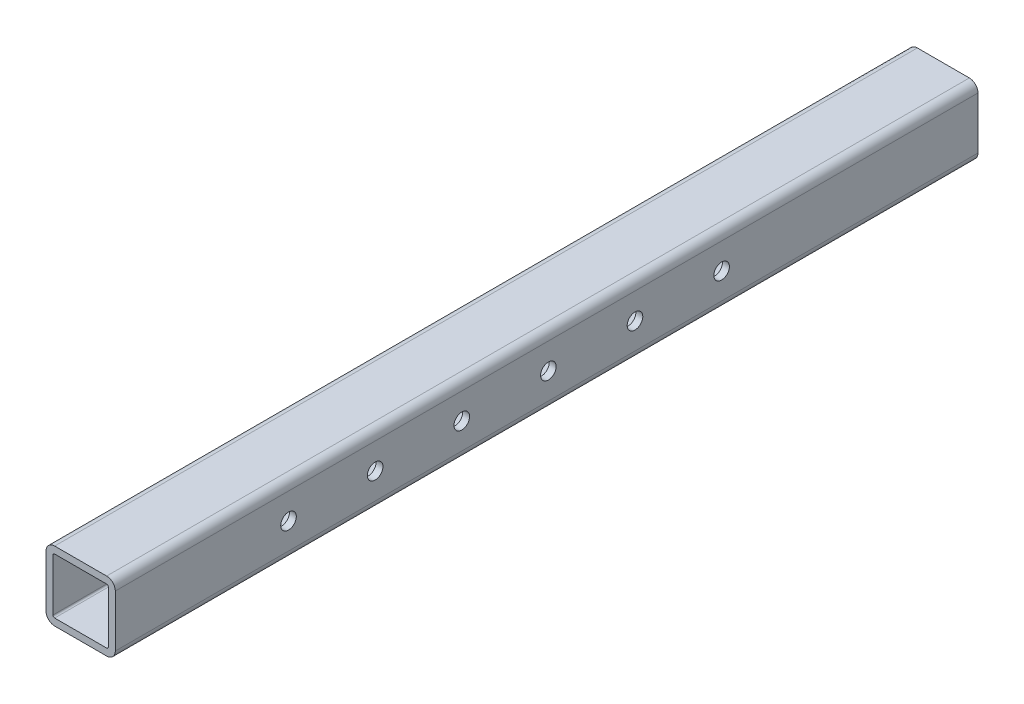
from build123d import *

# Parameters (mm, degrees)
BASE_EXTRUSION_DEPTH    = 498
ESQUISSE2_R             = 4.5
ENL_V_MAT_EXTRU_1_DEPTH = 502.202553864


with BuildPart() as part:
    # Esquisse1 → Base-Extrusion (new body)
    with BuildSketch(Plane.XY):
        with BuildLine():
            Line((5, 0), (35, 0))
            ThreePointArc((35, 0), (38.535533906, -1.464466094), (40, -5))
            Line((40, -5), (40, -35))
            ThreePointArc((40, -35), (38.535533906, -38.535533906), (35, -40))
            Line((35, -40), (5, -40))
            ThreePointArc((5, -40), (1.464466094, -38.535533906), (0, -35))
            Line((0, -35), (0, -5))
            ThreePointArc((0, -5), (1.464466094, -1.464466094), (5, 0))
        make_face()
        with BuildLine():
            Line((5, -4), (35, -4))
            ThreePointArc((35, -4), (35.707106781, -4.292893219), (36, -5))
            Line((36, -5), (36, -35))
            ThreePointArc((36, -35), (35.707106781, -35.707106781), (35, -36))
            Line((35, -36), (5, -36))
            ThreePointArc((5, -36), (4.292893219, -35.707106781), (4, -35))
            Line((4, -35), (4, -5))
            ThreePointArc((4, -5), (4.292893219, -4.292893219), (5, -4))
        make_face(mode=Mode.SUBTRACT)
    extrude(amount=BASE_EXTRUSION_DEPTH)

    # Esquisse2 → Enl_v. mat.-Extru.1 (cut, through all)
    with BuildSketch(Plane.ZY):
        with Locations(Location((398, -20, 0), (0, 0, 270))):
            Circle(ESQUISSE2_R)
        with Locations(Location((348, -20, 0), (0, 0, 270))):
            Circle(ESQUISSE2_R)
        with Locations(Location((298, -20, 0), (0, 0, 270))):
            Circle(ESQUISSE2_R)
        with Locations(Location((248, -20, 0), (0, 0, 270))):
            Circle(ESQUISSE2_R)
        with Locations(Location((198, -20, 0), (0, 0, 270))):
            Circle(ESQUISSE2_R)
        with Locations(Location((148, -20, 0), (0, 0, 270))):
            Circle(ESQUISSE2_R)
    extrude(amount=-ENL_V_MAT_EXTRU_1_DEPTH, mode=Mode.SUBTRACT)


solid = part.part
